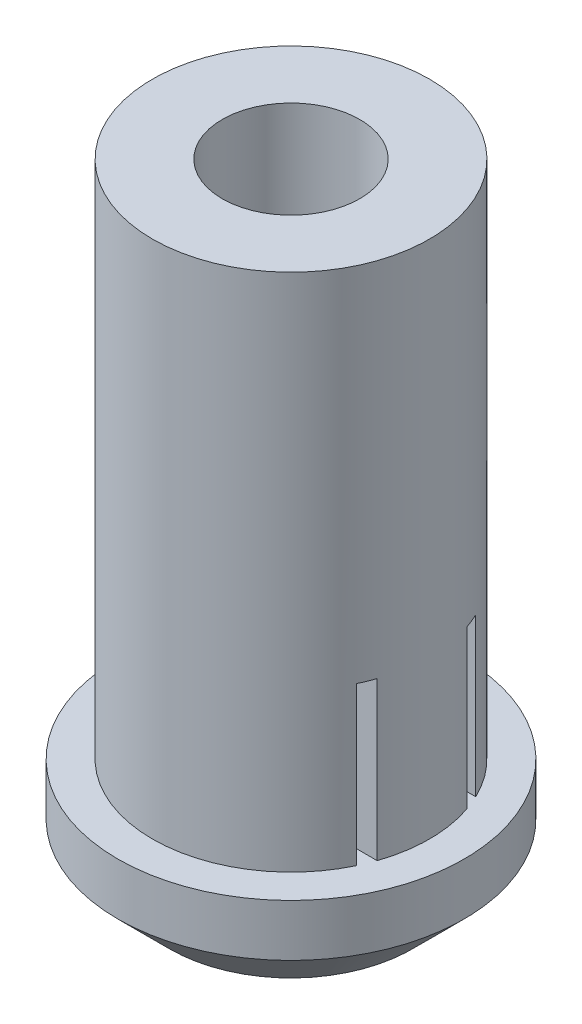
ISO-10303-21;
HEADER;
FILE_DESCRIPTION(('STEP AP214'),'2;1');
FILE_NAME('part.step','',(''),(''),'','','');
FILE_SCHEMA(('AUTOMOTIVE_DESIGN { 1 0 10303 214 1 1 1 1 }'));
ENDSEC;
DATA;
#1=APPLICATION_CONTEXT('core data for automotive mechanical design processes');
#2=APPLICATION_PROTOCOL_DEFINITION('international standard','automotive_design',2000,#1);
#3=PRODUCT_CONTEXT('',#1,'mechanical');
#4=PRODUCT('Part','Part','',(#3));
#5=PRODUCT_RELATED_PRODUCT_CATEGORY('part','',(#4));
#6=PRODUCT_DEFINITION_FORMATION('','',#4);
#7=PRODUCT_DEFINITION_CONTEXT('part definition',#1,'design');
#8=PRODUCT_DEFINITION('design','',#6,#7);
#9=PRODUCT_DEFINITION_SHAPE('','',#8);
#10=(LENGTH_UNIT() NAMED_UNIT(*) SI_UNIT(.MILLI.,.METRE.));
#11=(NAMED_UNIT(*) PLANE_ANGLE_UNIT() SI_UNIT($,.RADIAN.));
#12=(NAMED_UNIT(*) SI_UNIT($,.STERADIAN.) SOLID_ANGLE_UNIT());
#13=UNCERTAINTY_MEASURE_WITH_UNIT(LENGTH_MEASURE(1.E-05),#10,'distance_accuracy_value','');
#14=(GEOMETRIC_REPRESENTATION_CONTEXT(3) GLOBAL_UNCERTAINTY_ASSIGNED_CONTEXT((#13)) GLOBAL_UNIT_ASSIGNED_CONTEXT((#10,
#11,#12)) REPRESENTATION_CONTEXT('',''));
#15=CARTESIAN_POINT('',(0.,0.,0.));
#16=DIRECTION('',(0.,0.,1.));
#17=DIRECTION('',(1.,0.,0.));
#18=AXIS2_PLACEMENT_3D('',#15,#16,#17);
#19=CARTESIAN_POINT('',(0.,3.,0.));
#20=DIRECTION('',(0.,1.,0.));
#21=DIRECTION('',(0.,0.,1.));
#22=AXIS2_PLACEMENT_3D('',#19,#20,#21);
#23=CYLINDRICAL_SURFACE('',#22,4.);
#24=CARTESIAN_POINT('',(0.,18.,0.));
#25=DIRECTION('',(0.,1.,0.));
#26=DIRECTION('',(0.,0.,1.));
#27=AXIS2_PLACEMENT_3D('',#24,#25,#26);
#28=CIRCLE('',#27,4.);
#29=CARTESIAN_POINT('',(0.,18.,4.));
#30=VERTEX_POINT('',#29);
#31=EDGE_CURVE('E123',#30,#30,#28,.T.);
#32=ORIENTED_EDGE('',*,*,#31,.F.);
#33=EDGE_LOOP('',(#32));
#34=FACE_BOUND('',#33,.T.);
#35=CARTESIAN_POINT('',(0.,3.,0.));
#36=DIRECTION('',(0.,1.,0.));
#37=DIRECTION('',(0.,0.,1.));
#38=AXIS2_PLACEMENT_3D('',#35,#36,#37);
#39=CIRCLE('',#38,4.);
#40=CARTESIAN_POINT('',(3.78412673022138,3.,1.29629660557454));
#41=VERTEX_POINT('',#40);
#42=CARTESIAN_POINT('',(3.78412673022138,3.,-1.29629660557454));
#43=VERTEX_POINT('',#42);
#44=EDGE_CURVE('E115',#41,#43,#39,.T.);
#45=ORIENTED_EDGE('',*,*,#44,.T.);
#46=DIRECTION('',(0.,1.,0.));
#47=VECTOR('',#46,1.);
#48=CARTESIAN_POINT('',(3.78412673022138,3.,-1.29629660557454));
#49=LINE('',#48,#47);
#50=CARTESIAN_POINT('',(3.78412673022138,7.55181683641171,-1.29629660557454));
#51=VERTEX_POINT('',#50);
#52=EDGE_CURVE('E153',#43,#51,#49,.T.);
#53=ORIENTED_EDGE('',*,*,#52,.T.);
#54=CARTESIAN_POINT('',(0.,7.55181683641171,0.));
#55=DIRECTION('',(0.,-1.,0.));
#56=DIRECTION('',(0.,0.,-1.));
#57=AXIS2_PLACEMENT_3D('',#54,#55,#56);
#58=CIRCLE('',#57,4.);
#59=CARTESIAN_POINT('',(3.60931201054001,7.55181683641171,-1.72420033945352));
#60=VERTEX_POINT('',#59);
#61=EDGE_CURVE('E148',#51,#60,#58,.F.);
#62=ORIENTED_EDGE('',*,*,#61,.T.);
#63=DIRECTION('',(0.,1.,0.));
#64=VECTOR('',#63,1.);
#65=CARTESIAN_POINT('',(3.60931201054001,3.,-1.72420033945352));
#66=LINE('',#65,#64);
#67=CARTESIAN_POINT('',(3.60931201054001,3.,-1.72420033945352));
#68=VERTEX_POINT('',#67);
#69=EDGE_CURVE('E103',#60,#68,#66,.F.);
#70=ORIENTED_EDGE('',*,*,#69,.T.);
#71=CARTESIAN_POINT('',(-3.60931201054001,3.,-1.72420033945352));
#72=VERTEX_POINT('',#71);
#73=EDGE_CURVE('E110',#68,#72,#39,.T.);
#74=ORIENTED_EDGE('',*,*,#73,.T.);
#75=DIRECTION('',(0.,1.,0.));
#76=VECTOR('',#75,1.);
#77=CARTESIAN_POINT('',(-3.60931201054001,3.,-1.72420033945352));
#78=LINE('',#77,#76);
#79=CARTESIAN_POINT('',(-3.60931201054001,7.55181683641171,-1.72420033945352));
#80=VERTEX_POINT('',#79);
#81=EDGE_CURVE('E98',#72,#80,#78,.T.);
#82=ORIENTED_EDGE('',*,*,#81,.T.);
#83=CARTESIAN_POINT('',(-3.78412673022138,7.55181683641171,-1.29629660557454));
#84=VERTEX_POINT('',#83);
#85=EDGE_CURVE('E147',#80,#84,#58,.F.);
#86=ORIENTED_EDGE('',*,*,#85,.T.);
#87=DIRECTION('',(0.,1.,0.));
#88=VECTOR('',#87,1.);
#89=CARTESIAN_POINT('',(-3.78412673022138,3.,-1.29629660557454));
#90=LINE('',#89,#88);
#91=CARTESIAN_POINT('',(-3.78412673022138,3.,-1.29629660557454));
#92=VERTEX_POINT('',#91);
#93=EDGE_CURVE('E162',#84,#92,#90,.F.);
#94=ORIENTED_EDGE('',*,*,#93,.T.);
#95=CARTESIAN_POINT('',(-3.78412673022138,3.,1.29629660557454));
#96=VERTEX_POINT('',#95);
#97=EDGE_CURVE('E116',#92,#96,#39,.T.);
#98=ORIENTED_EDGE('',*,*,#97,.T.);
#99=DIRECTION('',(0.,1.,0.));
#100=VECTOR('',#99,1.);
#101=CARTESIAN_POINT('',(-3.78412673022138,3.,1.29629660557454));
#102=LINE('',#101,#100);
#103=CARTESIAN_POINT('',(-3.78412673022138,7.55181683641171,1.29629660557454));
#104=VERTEX_POINT('',#103);
#105=EDGE_CURVE('E141',#96,#104,#102,.T.);
#106=ORIENTED_EDGE('',*,*,#105,.T.);
#107=CARTESIAN_POINT('',(0.,7.55181683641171,0.));
#108=DIRECTION('',(0.,-1.,0.));
#109=DIRECTION('',(0.,0.,-1.));
#110=AXIS2_PLACEMENT_3D('',#107,#108,#109);
#111=CIRCLE('',#110,4.);
#112=CARTESIAN_POINT('',(-3.60931201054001,7.55181683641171,1.72420033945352));
#113=VERTEX_POINT('',#112);
#114=EDGE_CURVE('E135',#104,#113,#111,.F.);
#115=ORIENTED_EDGE('',*,*,#114,.T.);
#116=DIRECTION('',(0.,1.,0.));
#117=VECTOR('',#116,1.);
#118=CARTESIAN_POINT('',(-3.60931201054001,3.,1.72420033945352));
#119=LINE('',#118,#117);
#120=CARTESIAN_POINT('',(-3.60931201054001,3.,1.72420033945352));
#121=VERTEX_POINT('',#120);
#122=EDGE_CURVE('E144',#113,#121,#119,.F.);
#123=ORIENTED_EDGE('',*,*,#122,.T.);
#124=CARTESIAN_POINT('',(3.60931201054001,3.,1.72420033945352));
#125=VERTEX_POINT('',#124);
#126=EDGE_CURVE('E119',#121,#125,#39,.T.);
#127=ORIENTED_EDGE('',*,*,#126,.T.);
#128=DIRECTION('',(0.,1.,0.));
#129=VECTOR('',#128,1.);
#130=CARTESIAN_POINT('',(3.60931201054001,3.,1.72420033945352));
#131=LINE('',#130,#129);
#132=CARTESIAN_POINT('',(3.60931201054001,7.55181683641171,1.72420033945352));
#133=VERTEX_POINT('',#132);
#134=EDGE_CURVE('E138',#125,#133,#131,.T.);
#135=ORIENTED_EDGE('',*,*,#134,.T.);
#136=CARTESIAN_POINT('',(3.78412673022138,7.55181683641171,1.29629660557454));
#137=VERTEX_POINT('',#136);
#138=EDGE_CURVE('E131',#133,#137,#111,.F.);
#139=ORIENTED_EDGE('',*,*,#138,.T.);
#140=DIRECTION('',(0.,1.,0.));
#141=VECTOR('',#140,1.);
#142=CARTESIAN_POINT('',(3.78412673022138,3.,1.29629660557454));
#143=LINE('',#142,#141);
#144=EDGE_CURVE('E134',#137,#41,#143,.F.);
#145=ORIENTED_EDGE('',*,*,#144,.T.);
#146=EDGE_LOOP('',(#45,#53,#62,#70,#74,#82,#86,#94,#98,#106,#115,#123,#127,#135,#139,#145));
#147=FACE_BOUND('',#146,.T.);
#148=ADVANCED_FACE('F36',(#34,#147),#23,.T.);
#149=CARTESIAN_POINT('',(0.,18.,0.));
#150=DIRECTION('',(0.,-1.,0.));
#151=DIRECTION('',(0.,0.,-1.));
#152=AXIS2_PLACEMENT_3D('',#149,#150,#151);
#153=CYLINDRICAL_SURFACE('',#152,5.);
#154=CARTESIAN_POINT('',(0.,1.5,0.));
#155=DIRECTION('',(0.,1.,0.));
#156=DIRECTION('',(0.,0.,1.));
#157=AXIS2_PLACEMENT_3D('',#154,#155,#156);
#158=CIRCLE('',#157,5.);
#159=CARTESIAN_POINT('',(0.,1.5,5.));
#160=VERTEX_POINT('',#159);
#161=EDGE_CURVE('E44',#160,#160,#158,.T.);
#162=ORIENTED_EDGE('',*,*,#161,.T.);
#163=EDGE_LOOP('',(#162));
#164=FACE_BOUND('',#163,.T.);
#165=CARTESIAN_POINT('',(0.,3.,0.));
#166=DIRECTION('',(0.,1.,0.));
#167=DIRECTION('',(0.,0.,1.));
#168=AXIS2_PLACEMENT_3D('',#165,#166,#167);
#169=CIRCLE('',#168,5.);
#170=CARTESIAN_POINT('',(0.,3.,5.));
#171=VERTEX_POINT('',#170);
#172=EDGE_CURVE('E118',#171,#171,#169,.T.);
#173=ORIENTED_EDGE('',*,*,#172,.F.);
#174=EDGE_LOOP('',(#173));
#175=FACE_BOUND('',#174,.T.);
#176=ADVANCED_FACE('F194',(#164,#175),#153,.T.);
#177=CARTESIAN_POINT('',(0.,0.,0.));
#178=DIRECTION('',(0.,1.,0.));
#179=DIRECTION('',(0.,0.,1.));
#180=AXIS2_PLACEMENT_3D('',#177,#178,#179);
#181=PLANE('',#180);
#182=CARTESIAN_POINT('',(0.,0.,0.));
#183=DIRECTION('',(0.,1.,0.));
#184=DIRECTION('',(0.,0.,1.));
#185=AXIS2_PLACEMENT_3D('',#182,#183,#184);
#186=CIRCLE('',#185,3.49999999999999);
#187=CARTESIAN_POINT('',(0.,0.,3.49999999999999));
#188=VERTEX_POINT('',#187);
#189=EDGE_CURVE('E12',#188,#188,#186,.F.);
#190=ORIENTED_EDGE('',*,*,#189,.T.);
#191=EDGE_LOOP('',(#190));
#192=FACE_BOUND('',#191,.T.);
#193=CARTESIAN_POINT('',(0.,0.,0.));
#194=DIRECTION('',(0.,-1.,0.));
#195=DIRECTION('',(0.,0.,-1.));
#196=AXIS2_PLACEMENT_3D('',#193,#194,#195);
#197=CIRCLE('',#196,2.18459521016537);
#198=CARTESIAN_POINT('',(0.,0.,-2.18459521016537));
#199=VERTEX_POINT('',#198);
#200=EDGE_CURVE('E124',#199,#199,#197,.T.);
#201=ORIENTED_EDGE('',*,*,#200,.F.);
#202=EDGE_LOOP('',(#201));
#203=FACE_BOUND('',#202,.T.);
#204=ADVANCED_FACE('F192',(#192,#203),#181,.F.);
#205=CARTESIAN_POINT('',(0.,3.,0.));
#206=DIRECTION('',(0.,1.,0.));
#207=DIRECTION('',(0.,0.,1.));
#208=AXIS2_PLACEMENT_3D('',#205,#206,#207);
#209=PLANE('',#208);
#210=ORIENTED_EDGE('',*,*,#97,.F.);
#211=DIRECTION('',(-1.,0.,0.));
#212=VECTOR('',#211,1.);
#213=CARTESIAN_POINT('',(6.,3.,-1.29629660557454));
#214=LINE('',#213,#212);
#215=EDGE_CURVE('E111',#43,#92,#214,.T.);
#216=ORIENTED_EDGE('',*,*,#215,.F.);
#217=ORIENTED_EDGE('',*,*,#44,.F.);
#218=DIRECTION('',(-1.,0.,0.));
#219=VECTOR('',#218,1.);
#220=CARTESIAN_POINT('',(6.,3.,1.29629660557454));
#221=LINE('',#220,#219);
#222=EDGE_CURVE('E174',#41,#96,#221,.T.);
#223=ORIENTED_EDGE('',*,*,#222,.T.);
#224=EDGE_LOOP('',(#210,#216,#217,#223));
#225=FACE_BOUND('',#224,.T.);
#226=ORIENTED_EDGE('',*,*,#73,.F.);
#227=DIRECTION('',(-1.,0.,0.));
#228=VECTOR('',#227,1.);
#229=CARTESIAN_POINT('',(6.,3.,-1.72420033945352));
#230=LINE('',#229,#228);
#231=EDGE_CURVE('E56',#68,#72,#230,.T.);
#232=ORIENTED_EDGE('',*,*,#231,.T.);
#233=EDGE_LOOP('',(#226,#232));
#234=FACE_BOUND('',#233,.T.);
#235=ORIENTED_EDGE('',*,*,#172,.T.);
#236=EDGE_LOOP('',(#235));
#237=FACE_BOUND('',#236,.T.);
#238=DIRECTION('',(-1.,0.,0.));
#239=VECTOR('',#238,1.);
#240=CARTESIAN_POINT('',(6.,3.,1.72420033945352));
#241=LINE('',#240,#239);
#242=EDGE_CURVE('E177',#125,#121,#241,.T.);
#243=ORIENTED_EDGE('',*,*,#242,.F.);
#244=ORIENTED_EDGE('',*,*,#126,.F.);
#245=EDGE_LOOP('',(#243,#244));
#246=FACE_BOUND('',#245,.T.);
#247=ADVANCED_FACE('F108',(#225,#234,#237,#246),#209,.T.);
#248=CARTESIAN_POINT('',(0.,18.,0.));
#249=DIRECTION('',(0.,1.,0.));
#250=DIRECTION('',(0.,0.,1.));
#251=AXIS2_PLACEMENT_3D('',#248,#249,#250);
#252=PLANE('',#251);
#253=CARTESIAN_POINT('',(0.,18.,0.));
#254=DIRECTION('',(0.,1.,0.));
#255=DIRECTION('',(0.,0.,1.));
#256=AXIS2_PLACEMENT_3D('',#253,#254,#255);
#257=CIRCLE('',#256,1.98444167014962);
#258=CARTESIAN_POINT('',(0.,18.,1.98444167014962));
#259=VERTEX_POINT('',#258);
#260=EDGE_CURVE('E179',#259,#259,#257,.T.);
#261=ORIENTED_EDGE('',*,*,#260,.F.);
#262=EDGE_LOOP('',(#261));
#263=FACE_BOUND('',#262,.T.);
#264=ORIENTED_EDGE('',*,*,#31,.T.);
#265=EDGE_LOOP('',(#264));
#266=FACE_BOUND('',#265,.T.);
#267=ADVANCED_FACE('F201',(#263,#266),#252,.T.);
#268=CARTESIAN_POINT('',(0.,0.1,0.));
#269=DIRECTION('',(0.,-1.,0.));
#270=DIRECTION('',(0.,0.,-1.));
#271=AXIS2_PLACEMENT_3D('',#268,#269,#270);
#272=CYLINDRICAL_SURFACE('',#271,2.18459521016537);
#273=CARTESIAN_POINT('',(0.,0.1,0.));
#274=DIRECTION('',(0.,-1.,0.));
#275=DIRECTION('',(0.,0.,-1.));
#276=AXIS2_PLACEMENT_3D('',#273,#274,#275);
#277=CIRCLE('',#276,2.18459521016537);
#278=CARTESIAN_POINT('',(0.,0.1,-2.18459521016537));
#279=VERTEX_POINT('',#278);
#280=EDGE_CURVE('E128',#279,#279,#277,.T.);
#281=ORIENTED_EDGE('',*,*,#280,.F.);
#282=EDGE_LOOP('',(#281));
#283=FACE_BOUND('',#282,.T.);
#284=ORIENTED_EDGE('',*,*,#200,.T.);
#285=EDGE_LOOP('',(#284));
#286=FACE_BOUND('',#285,.T.);
#287=ADVANCED_FACE('F190',(#283,#286),#272,.F.);
#288=CARTESIAN_POINT('',(0.,0.1,0.));
#289=DIRECTION('',(0.,-1.,0.));
#290=DIRECTION('',(0.,0.,-1.));
#291=AXIS2_PLACEMENT_3D('',#288,#289,#290);
#292=PLANE('',#291);
#293=ORIENTED_EDGE('',*,*,#280,.T.);
#294=EDGE_LOOP('',(#293));
#295=FACE_BOUND('',#294,.T.);
#296=ADVANCED_FACE('F218',(#295),#292,.T.);
#297=CARTESIAN_POINT('',(0.,12.,0.));
#298=DIRECTION('',(0.,1.,0.));
#299=DIRECTION('',(0.,0.,1.));
#300=AXIS2_PLACEMENT_3D('',#297,#298,#299);
#301=CYLINDRICAL_SURFACE('',#300,1.98444167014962);
#302=CARTESIAN_POINT('',(0.,12.,0.));
#303=DIRECTION('',(0.,1.,0.));
#304=DIRECTION('',(0.,0.,1.));
#305=AXIS2_PLACEMENT_3D('',#302,#303,#304);
#306=CIRCLE('',#305,1.98444167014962);
#307=CARTESIAN_POINT('',(0.,12.,1.98444167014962));
#308=VERTEX_POINT('',#307);
#309=EDGE_CURVE('E180',#308,#308,#306,.T.);
#310=ORIENTED_EDGE('',*,*,#309,.F.);
#311=EDGE_LOOP('',(#310));
#312=FACE_BOUND('',#311,.T.);
#313=ORIENTED_EDGE('',*,*,#260,.T.);
#314=EDGE_LOOP('',(#313));
#315=FACE_BOUND('',#314,.T.);
#316=ADVANCED_FACE('F223',(#312,#315),#301,.F.);
#317=CARTESIAN_POINT('',(0.,12.,0.));
#318=DIRECTION('',(0.,1.,0.));
#319=DIRECTION('',(0.,0.,1.));
#320=AXIS2_PLACEMENT_3D('',#317,#318,#319);
#321=PLANE('',#320);
#322=ORIENTED_EDGE('',*,*,#309,.T.);
#323=EDGE_LOOP('',(#322));
#324=FACE_BOUND('',#323,.T.);
#325=ADVANCED_FACE('F225',(#324),#321,.T.);
#326=CARTESIAN_POINT('',(6.,7.55181683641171,1.72420033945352));
#327=DIRECTION('',(0.,0.,-1.));
#328=DIRECTION('',(-1.,0.,0.));
#329=AXIS2_PLACEMENT_3D('',#326,#327,#328);
#330=PLANE('',#329);
#331=DIRECTION('',(-1.,0.,0.));
#332=VECTOR('',#331,1.);
#333=CARTESIAN_POINT('',(6.,7.55181683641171,1.72420033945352));
#334=LINE('',#333,#332);
#335=EDGE_CURVE('E169',#133,#113,#334,.T.);
#336=ORIENTED_EDGE('',*,*,#335,.F.);
#337=ORIENTED_EDGE('',*,*,#134,.F.);
#338=ORIENTED_EDGE('',*,*,#242,.T.);
#339=ORIENTED_EDGE('',*,*,#122,.F.);
#340=EDGE_LOOP('',(#336,#337,#338,#339));
#341=FACE_BOUND('',#340,.T.);
#342=ADVANCED_FACE('F232',(#341),#330,.T.);
#343=CARTESIAN_POINT('',(6.,7.55181683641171,1.29629660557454));
#344=DIRECTION('',(0.,0.,1.));
#345=DIRECTION('',(1.,0.,0.));
#346=AXIS2_PLACEMENT_3D('',#343,#344,#345);
#347=PLANE('',#346);
#348=DIRECTION('',(-1.,0.,0.));
#349=VECTOR('',#348,1.);
#350=CARTESIAN_POINT('',(6.,7.55181683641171,1.29629660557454));
#351=LINE('',#350,#349);
#352=EDGE_CURVE('E171',#137,#104,#351,.T.);
#353=ORIENTED_EDGE('',*,*,#352,.T.);
#354=ORIENTED_EDGE('',*,*,#105,.F.);
#355=ORIENTED_EDGE('',*,*,#222,.F.);
#356=ORIENTED_EDGE('',*,*,#144,.F.);
#357=EDGE_LOOP('',(#353,#354,#355,#356));
#358=FACE_BOUND('',#357,.T.);
#359=ADVANCED_FACE('F239',(#358),#347,.T.);
#360=CARTESIAN_POINT('',(6.,7.55181683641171,1.72420033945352));
#361=DIRECTION('',(0.,-1.,0.));
#362=DIRECTION('',(0.,0.,-1.));
#363=AXIS2_PLACEMENT_3D('',#360,#361,#362);
#364=PLANE('',#363);
#365=ORIENTED_EDGE('',*,*,#352,.F.);
#366=ORIENTED_EDGE('',*,*,#138,.F.);
#367=ORIENTED_EDGE('',*,*,#335,.T.);
#368=ORIENTED_EDGE('',*,*,#114,.F.);
#369=EDGE_LOOP('',(#365,#366,#367,#368));
#370=FACE_BOUND('',#369,.T.);
#371=ADVANCED_FACE('F243',(#370),#364,.T.);
#372=CARTESIAN_POINT('',(6.,7.55181683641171,-1.72420033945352));
#373=DIRECTION('',(0.,-1.,0.));
#374=DIRECTION('',(0.,0.,-1.));
#375=AXIS2_PLACEMENT_3D('',#372,#373,#374);
#376=PLANE('',#375);
#377=DIRECTION('',(-1.,0.,0.));
#378=VECTOR('',#377,1.);
#379=CARTESIAN_POINT('',(6.,7.55181683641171,-1.72420033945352));
#380=LINE('',#379,#378);
#381=EDGE_CURVE('E51',#60,#80,#380,.T.);
#382=ORIENTED_EDGE('',*,*,#381,.F.);
#383=ORIENTED_EDGE('',*,*,#61,.F.);
#384=DIRECTION('',(-1.,0.,0.));
#385=VECTOR('',#384,1.);
#386=CARTESIAN_POINT('',(6.,7.55181683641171,-1.29629660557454));
#387=LINE('',#386,#385);
#388=EDGE_CURVE('E104',#51,#84,#387,.T.);
#389=ORIENTED_EDGE('',*,*,#388,.T.);
#390=ORIENTED_EDGE('',*,*,#85,.F.);
#391=EDGE_LOOP('',(#382,#383,#389,#390));
#392=FACE_BOUND('',#391,.T.);
#393=ADVANCED_FACE('F157',(#392),#376,.T.);
#394=CARTESIAN_POINT('',(6.,7.55181683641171,-1.29629660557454));
#395=DIRECTION('',(0.,0.,-1.));
#396=DIRECTION('',(-1.,0.,0.));
#397=AXIS2_PLACEMENT_3D('',#394,#395,#396);
#398=PLANE('',#397);
#399=ORIENTED_EDGE('',*,*,#388,.F.);
#400=ORIENTED_EDGE('',*,*,#52,.F.);
#401=ORIENTED_EDGE('',*,*,#215,.T.);
#402=ORIENTED_EDGE('',*,*,#93,.F.);
#403=EDGE_LOOP('',(#399,#400,#401,#402));
#404=FACE_BOUND('',#403,.T.);
#405=ADVANCED_FACE('F159',(#404),#398,.T.);
#406=CARTESIAN_POINT('',(6.,7.55181683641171,-1.72420033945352));
#407=DIRECTION('',(0.,0.,1.));
#408=DIRECTION('',(1.,0.,0.));
#409=AXIS2_PLACEMENT_3D('',#406,#407,#408);
#410=PLANE('',#409);
#411=ORIENTED_EDGE('',*,*,#381,.T.);
#412=ORIENTED_EDGE('',*,*,#81,.F.);
#413=ORIENTED_EDGE('',*,*,#231,.F.);
#414=ORIENTED_EDGE('',*,*,#69,.F.);
#415=EDGE_LOOP('',(#411,#412,#413,#414));
#416=FACE_BOUND('',#415,.T.);
#417=ADVANCED_FACE('F99',(#416),#410,.T.);
#418=CARTESIAN_POINT('',(0.,1.5,0.));
#419=DIRECTION('',(0.,1.,0.));
#420=DIRECTION('',(0.,0.,1.));
#421=AXIS2_PLACEMENT_3D('',#418,#419,#420);
#422=CONICAL_SURFACE('',#421,5.,0.78539816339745);
#423=ORIENTED_EDGE('',*,*,#189,.F.);
#424=EDGE_LOOP('',(#423));
#425=FACE_BOUND('',#424,.T.);
#426=ORIENTED_EDGE('',*,*,#161,.F.);
#427=EDGE_LOOP('',(#426));
#428=FACE_BOUND('',#427,.T.);
#429=ADVANCED_FACE('F38',(#425,#428),#422,.T.);
#430=CLOSED_SHELL('',(#148,#176,#204,#247,#267,#287,#296,#316,#325,#342,#359,#371,#393,#405,
#417,#429));
#431=MANIFOLD_SOLID_BREP('B2',#430);
#432=ADVANCED_BREP_SHAPE_REPRESENTATION('',(#18,#431),#14);
#433=SHAPE_DEFINITION_REPRESENTATION(#9,#432);
ENDSEC;
END-ISO-10303-21;
